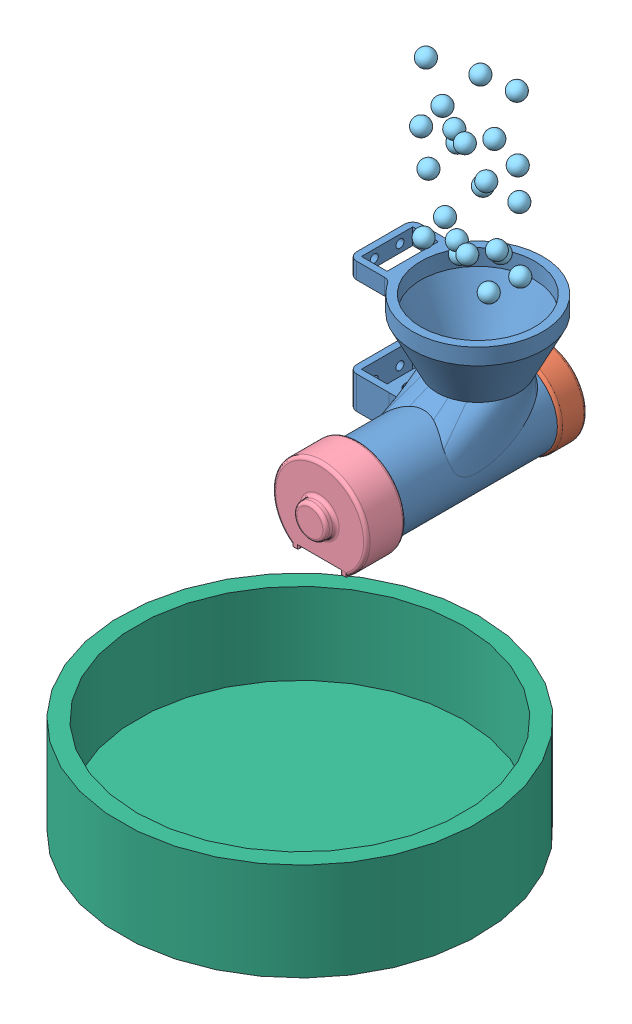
SolidWorks assembly Hopper-Augger Assembly.SLDASM, configuration Default (file format 15000). Lengths in mm.
Overall size (279.4 448.59 331.26).
28 component instances, 6 part files, 7 mates.
Components (placement in the parent):
- NSF Candy Hopper Main Part-1: NSF Candy Hopper Main Part.SLDPRT [Default] at (26.407 -0.9892 85.0747) size (127.67 120.65 170.15)
- NSF Auger Rear Cap-1: NSF Auger Rear Cap.SLDPRT [Default] at (26.407 -0.9892 -76.2153) x (0.031747 0.999496 0) z (0 0 -1) size (67.01 67.01 21.59)
- Sephra CF16E Auger Modified (1)-1: Sephra CF16E Auger Modified (1).SLDPRT [Original] at (26.407 -0.9892 -68.6197) x (0.209804 -0.977743 0) z (0 0 1) size (41.1 41.1 163.85)
- NSF Idler End Cap Rev 2-1: NSF Idler End Cap Rev 2.SLDPRT [Default] at (26.407 -0.9892 85.0747) x (0 1 0) z (0 0 1) size (67.53 73.66 38.42)
- Ball-1: Ball.SLDPRT [Default] at (24.7508 104.9209 -52.8592) size (12.78 12.78 12.78)
- place holder cup-1: place holder cup.SLDPRT [Default] at (27.3017 -205.2589 106.4548) size (279.4 76.2 279.4)
- Ball-2: Ball.SLDPRT [Default] at (39.6489 96.3709 -53.1986) size (12.78 12.78 12.78)
- Ball-3: Ball.SLDPRT [Default] at (44.5344 102.821 -23.7072) size (12.78 12.78 12.78)
- Ball-4: Ball.SLDPRT [Default] at (36.015 119.7564 -38.5552) size (12.78 12.78 12.78)
- Ball-5: Ball.SLDPRT [Default] at (15.5792 121.6819 -27.7189) size (12.78 12.78 12.78)
- Ball-6: Ball.SLDPRT [Default] at (6.7042 102.3127 -39.0406) size (12.78 12.78 12.78)
- Ball-7: Ball.SLDPRT [Default] at (7.7733 140.4471 -55.9116) size (12.78 12.78 12.78)
- Ball-8: Ball.SLDPRT [Default] at (27.5392 153.8688 -6.569) size (12.78 12.78 12.78)
- Ball-9: Ball.SLDPRT [Default] at (53.3172 160.8283 -38.8011) size (12.78 12.78 12.78)
- Ball-10: Ball.SLDPRT [Default] at (46.2626 138.6334 -5.2574) size (12.78 12.78 12.78)
- Ball-11: Ball.SLDPRT [Default] at (9.2388 130.0938 -8.169) size (12.78 12.78 12.78)
- Ball-12: Ball.SLDPRT [Default] at (-3.3946 162.0554 -24.5697) size (12.78 12.78 12.78)
- Ball-37: Ball.SLDPRT [Default] at (14.3341 196.5711 -27.0104) size (12.78 12.78 12.78)
- Ball-38: Ball.SLDPRT [Default] at (43.2893 177.7101 -22.9987) size (12.78 12.78 12.78)
- Ball-39: Ball.SLDPRT [Default] at (34.77 194.6455 -37.8467) size (12.78 12.78 12.78)
- Ball-40: Ball.SLDPRT [Default] at (5.4591 177.2019 -38.3321) size (12.78 12.78 12.78)
- Ball-41: Ball.SLDPRT [Default] at (6.5282 215.3362 -55.203) size (12.78 12.78 12.78)
- Ball-42: Ball.SLDPRT [Default] at (26.2941 228.7579 -5.8605) size (12.78 12.78 12.78)
- Ball-43: Ball.SLDPRT [Default] at (52.0721 235.7174 -38.0926) size (12.78 12.78 12.78)
- Ball-44: Ball.SLDPRT [Default] at (45.0175 213.5226 -4.5489) size (12.78 12.78 12.78)
- Ball-45: Ball.SLDPRT [Default] at (7.9937 204.9829 -7.4605) size (12.78 12.78 12.78)
- Ball-46: Ball.SLDPRT [Default] at (-4.6397 236.9445 -23.8612) size (12.78 12.78 12.78)
- Ball-47: Ball.SLDPRT [Default] at (38.4039 171.26 -52.4901) size (12.78 12.78 12.78)
Mates (geometry in assembly coordinates):
- Concentric1: concentric aligned: cylinder of NSF Candy Hopper Main Part-1 through (26.407 -0.9892 -92.7253) axis (0 0 1) radius 31.75; cylinder of NSF Idler End Cap Rev 2-1 through (26.407 -0.9892 59.6747) axis (0 0 1) radius 31.75
- Perpendicular1: perpendicular: plane of NSF Candy Hopper Main Part-1 through (9.897 -32.7392 86.3447) normal (1 0 0); plane of NSF Idler End Cap Rev 2-1 through (47.1493 -28.2942 59.6747) normal (0 -1 0)
- Coincident2: coincident anti-aligned: plane of NSF Candy Hopper Main Part-1 through (26.407 -0.9892 -80.0253) normal (0 0 -1); plane of NSF Auger Rear Cap-1 through (26.407 -0.9892 -80.0253) normal (0 0 1)
- Concentric2: concentric aligned: cylinder of NSF Candy Hopper Main Part-1 through (26.407 -0.9892 -67.3253) axis (0 0 -1) radius 28.448; cylinder of NSF Auger Rear Cap-1 through (26.407 -0.9892 -63.5153) axis (0 0 -1) radius 33.5026
- Concentric3: concentric anti-aligned: cylinder of NSF Auger Rear Cap-1 through (26.407 -0.9892 -85.1053) axis (0 0 1) radius 7.62; cylinder of Sephra CF16E Auger Modified (1)-1 through (26.407 -0.9892 -52.5669) axis (0 0 -1) radius 6.8834
- Coincident3: coincident anti-aligned: plane of Sephra CF16E Auger Modified (1)-1 through (26.407 -0.9892 95.2347) normal (0 0 1); plane of NSF Idler End Cap Rev 2-1 through (26.407 -0.9892 95.2347) normal (0 0 -1)
- Coincident4: coincident anti-aligned: plane of NSF Candy Hopper Main Part-1 through (26.407 -0.9892 85.0747) normal (0 0 1); plane of NSF Idler End Cap Rev 2-1 through (26.407 -0.9892 85.0747) normal (0 0 -1)
